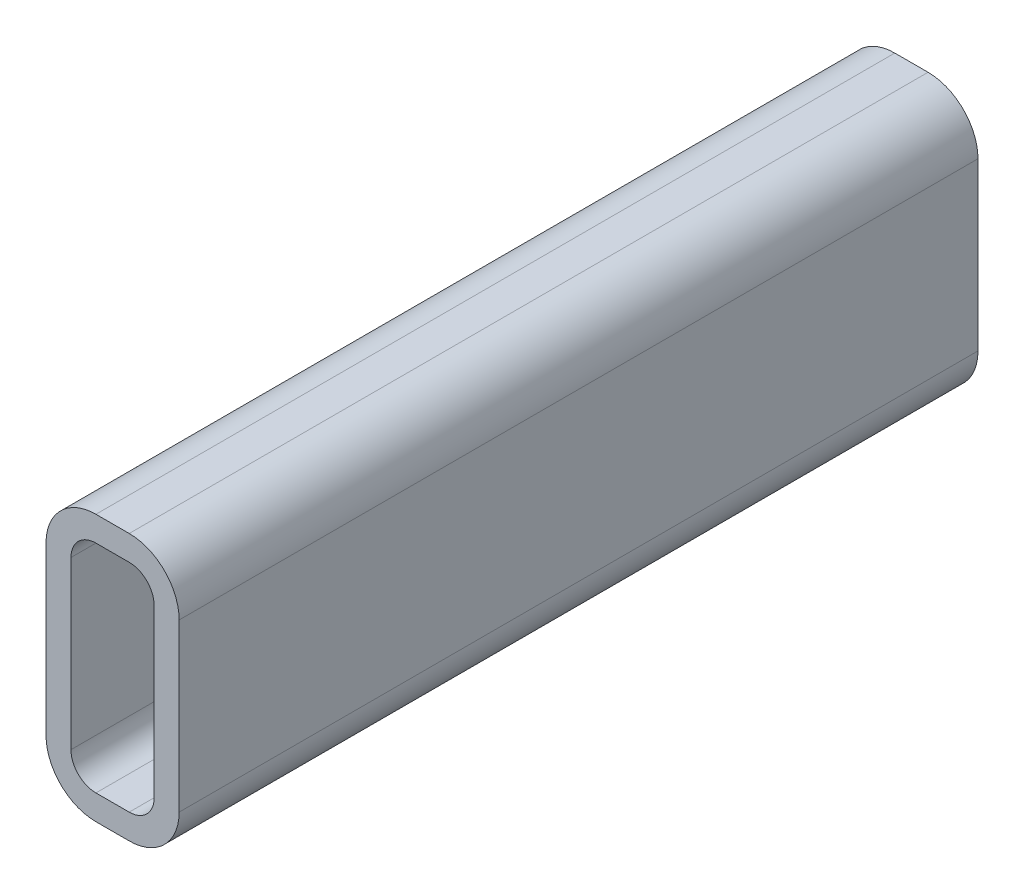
ISO-10303-21;
HEADER;
FILE_DESCRIPTION(('STEP AP214'),'2;1');
FILE_NAME('part.step','',(''),(''),'','','');
FILE_SCHEMA(('AUTOMOTIVE_DESIGN { 1 0 10303 214 1 1 1 1 }'));
ENDSEC;
DATA;
#1=APPLICATION_CONTEXT('core data for automotive mechanical design processes');
#2=APPLICATION_PROTOCOL_DEFINITION('international standard','automotive_design',2000,#1);
#3=PRODUCT_CONTEXT('',#1,'mechanical');
#4=PRODUCT('Part','Part','',(#3));
#5=PRODUCT_RELATED_PRODUCT_CATEGORY('part','',(#4));
#6=PRODUCT_DEFINITION_FORMATION('','',#4);
#7=PRODUCT_DEFINITION_CONTEXT('part definition',#1,'design');
#8=PRODUCT_DEFINITION('design','',#6,#7);
#9=PRODUCT_DEFINITION_SHAPE('','',#8);
#10=(LENGTH_UNIT() NAMED_UNIT(*) SI_UNIT(.MILLI.,.METRE.));
#11=(NAMED_UNIT(*) PLANE_ANGLE_UNIT() SI_UNIT($,.RADIAN.));
#12=(NAMED_UNIT(*) SI_UNIT($,.STERADIAN.) SOLID_ANGLE_UNIT());
#13=UNCERTAINTY_MEASURE_WITH_UNIT(LENGTH_MEASURE(1.E-05),#10,'distance_accuracy_value','');
#14=(GEOMETRIC_REPRESENTATION_CONTEXT(3) GLOBAL_UNCERTAINTY_ASSIGNED_CONTEXT((#13)) GLOBAL_UNIT_ASSIGNED_CONTEXT((#10,
#11,#12)) REPRESENTATION_CONTEXT('',''));
#15=CARTESIAN_POINT('',(0.,0.,0.));
#16=DIRECTION('',(0.,0.,1.));
#17=DIRECTION('',(1.,0.,0.));
#18=AXIS2_PLACEMENT_3D('',#15,#16,#17);
#19=CARTESIAN_POINT('',(19.05,82.55,304.8));
#20=DIRECTION('',(0.,0.,1.));
#21=DIRECTION('',(1.,0.,0.));
#22=AXIS2_PLACEMENT_3D('',#19,#20,#21);
#23=PLANE('',#22);
#24=CARTESIAN_POINT('',(19.05,82.55,304.8));
#25=DIRECTION('',(0.,0.,1.));
#26=DIRECTION('',(1.,0.,0.));
#27=AXIS2_PLACEMENT_3D('',#24,#25,#26);
#28=CIRCLE('',#27,19.05);
#29=CARTESIAN_POINT('',(19.05,101.6,304.8));
#30=VERTEX_POINT('',#29);
#31=CARTESIAN_POINT('',(0.,82.55,304.8));
#32=VERTEX_POINT('',#31);
#33=EDGE_CURVE('E211',#30,#32,#28,.T.);
#34=ORIENTED_EDGE('',*,*,#33,.T.);
#35=DIRECTION('',(0.,-1.,0.));
#36=VECTOR('',#35,1.);
#37=CARTESIAN_POINT('',(0.,19.05,304.8));
#38=LINE('',#37,#36);
#39=CARTESIAN_POINT('',(0.,19.05,304.8));
#40=VERTEX_POINT('',#39);
#41=EDGE_CURVE('E214',#32,#40,#38,.T.);
#42=ORIENTED_EDGE('',*,*,#41,.T.);
#43=CARTESIAN_POINT('',(19.05,19.05,304.8));
#44=DIRECTION('',(0.,0.,1.));
#45=DIRECTION('',(1.,0.,0.));
#46=AXIS2_PLACEMENT_3D('',#43,#44,#45);
#47=CIRCLE('',#46,19.05);
#48=CARTESIAN_POINT('',(19.05,0.,304.8));
#49=VERTEX_POINT('',#48);
#50=EDGE_CURVE('E217',#40,#49,#47,.T.);
#51=ORIENTED_EDGE('',*,*,#50,.T.);
#52=DIRECTION('',(1.,0.,0.));
#53=VECTOR('',#52,1.);
#54=CARTESIAN_POINT('',(31.75,0.,304.8));
#55=LINE('',#54,#53);
#56=CARTESIAN_POINT('',(31.75,0.,304.8));
#57=VERTEX_POINT('',#56);
#58=EDGE_CURVE('E219',#49,#57,#55,.T.);
#59=ORIENTED_EDGE('',*,*,#58,.T.);
#60=CARTESIAN_POINT('',(31.75,19.05,304.8));
#61=DIRECTION('',(0.,0.,1.));
#62=DIRECTION('',(1.,0.,0.));
#63=AXIS2_PLACEMENT_3D('',#60,#61,#62);
#64=CIRCLE('',#63,19.05);
#65=CARTESIAN_POINT('',(50.8,19.05,304.8));
#66=VERTEX_POINT('',#65);
#67=EDGE_CURVE('E221',#57,#66,#64,.T.);
#68=ORIENTED_EDGE('',*,*,#67,.T.);
#69=DIRECTION('',(0.,1.,0.));
#70=VECTOR('',#69,1.);
#71=CARTESIAN_POINT('',(50.8,82.55,304.8));
#72=LINE('',#71,#70);
#73=CARTESIAN_POINT('',(50.8,82.55,304.8));
#74=VERTEX_POINT('',#73);
#75=EDGE_CURVE('E223',#66,#74,#72,.T.);
#76=ORIENTED_EDGE('',*,*,#75,.T.);
#77=CARTESIAN_POINT('',(31.75,82.55,304.8));
#78=DIRECTION('',(0.,0.,1.));
#79=DIRECTION('',(1.,0.,0.));
#80=AXIS2_PLACEMENT_3D('',#77,#78,#79);
#81=CIRCLE('',#80,19.05);
#82=CARTESIAN_POINT('',(31.75,101.6,304.8));
#83=VERTEX_POINT('',#82);
#84=EDGE_CURVE('E225',#74,#83,#81,.T.);
#85=ORIENTED_EDGE('',*,*,#84,.T.);
#86=DIRECTION('',(-1.,0.,0.));
#87=VECTOR('',#86,1.);
#88=CARTESIAN_POINT('',(19.05,101.6,304.8));
#89=LINE('',#88,#87);
#90=EDGE_CURVE('E227',#83,#30,#89,.T.);
#91=ORIENTED_EDGE('',*,*,#90,.T.);
#92=EDGE_LOOP('',(#34,#42,#51,#59,#68,#76,#85,#91));
#93=FACE_BOUND('',#92,.T.);
#94=DIRECTION('',(0.,-1.,0.));
#95=VECTOR('',#94,1.);
#96=CARTESIAN_POINT('',(9.525,19.05,304.8));
#97=LINE('',#96,#95);
#98=CARTESIAN_POINT('',(9.525,82.55,304.8));
#99=VERTEX_POINT('',#98);
#100=CARTESIAN_POINT('',(9.525,19.05,304.8));
#101=VERTEX_POINT('',#100);
#102=EDGE_CURVE('E154',#99,#101,#97,.T.);
#103=ORIENTED_EDGE('',*,*,#102,.F.);
#104=CARTESIAN_POINT('',(19.05,82.55,304.8));
#105=DIRECTION('',(0.,0.,1.));
#106=DIRECTION('',(1.,0.,0.));
#107=AXIS2_PLACEMENT_3D('',#104,#105,#106);
#108=CIRCLE('',#107,9.525);
#109=CARTESIAN_POINT('',(19.05,92.075,304.8));
#110=VERTEX_POINT('',#109);
#111=EDGE_CURVE('E146',#110,#99,#108,.T.);
#112=ORIENTED_EDGE('',*,*,#111,.F.);
#113=DIRECTION('',(-1.,0.,0.));
#114=VECTOR('',#113,1.);
#115=CARTESIAN_POINT('',(19.05,92.075,304.8));
#116=LINE('',#115,#114);
#117=CARTESIAN_POINT('',(31.75,92.075,304.8));
#118=VERTEX_POINT('',#117);
#119=EDGE_CURVE('E179',#118,#110,#116,.T.);
#120=ORIENTED_EDGE('',*,*,#119,.F.);
#121=CARTESIAN_POINT('',(31.75,82.55,304.8));
#122=DIRECTION('',(0.,0.,1.));
#123=DIRECTION('',(1.,0.,0.));
#124=AXIS2_PLACEMENT_3D('',#121,#122,#123);
#125=CIRCLE('',#124,9.525);
#126=CARTESIAN_POINT('',(41.275,82.55,304.8));
#127=VERTEX_POINT('',#126);
#128=EDGE_CURVE('E177',#127,#118,#125,.T.);
#129=ORIENTED_EDGE('',*,*,#128,.F.);
#130=DIRECTION('',(0.,1.,0.));
#131=VECTOR('',#130,1.);
#132=CARTESIAN_POINT('',(41.275,82.55,304.8));
#133=LINE('',#132,#131);
#134=CARTESIAN_POINT('',(41.275,19.05,304.8));
#135=VERTEX_POINT('',#134);
#136=EDGE_CURVE('E175',#135,#127,#133,.T.);
#137=ORIENTED_EDGE('',*,*,#136,.F.);
#138=CARTESIAN_POINT('',(31.75,19.05,304.8));
#139=DIRECTION('',(0.,0.,1.));
#140=DIRECTION('',(1.,0.,0.));
#141=AXIS2_PLACEMENT_3D('',#138,#139,#140);
#142=CIRCLE('',#141,9.525);
#143=CARTESIAN_POINT('',(31.75,9.525,304.8));
#144=VERTEX_POINT('',#143);
#145=EDGE_CURVE('E173',#144,#135,#142,.T.);
#146=ORIENTED_EDGE('',*,*,#145,.F.);
#147=DIRECTION('',(1.,0.,0.));
#148=VECTOR('',#147,1.);
#149=CARTESIAN_POINT('',(31.75,9.525,304.8));
#150=LINE('',#149,#148);
#151=CARTESIAN_POINT('',(19.05,9.525,304.8));
#152=VERTEX_POINT('',#151);
#153=EDGE_CURVE('E169',#152,#144,#150,.T.);
#154=ORIENTED_EDGE('',*,*,#153,.F.);
#155=CARTESIAN_POINT('',(19.05,19.05,304.8));
#156=DIRECTION('',(0.,0.,1.));
#157=DIRECTION('',(1.,0.,0.));
#158=AXIS2_PLACEMENT_3D('',#155,#156,#157);
#159=CIRCLE('',#158,9.525);
#160=EDGE_CURVE('E167',#101,#152,#159,.T.);
#161=ORIENTED_EDGE('',*,*,#160,.F.);
#162=EDGE_LOOP('',(#103,#112,#120,#129,#137,#146,#154,#161));
#163=FACE_BOUND('',#162,.T.);
#164=ADVANCED_FACE('F33',(#93,#163),#23,.T.);
#165=CARTESIAN_POINT('',(19.05,82.55,0.));
#166=DIRECTION('',(0.,0.,1.));
#167=DIRECTION('',(1.,0.,0.));
#168=AXIS2_PLACEMENT_3D('',#165,#166,#167);
#169=PLANE('',#168);
#170=CARTESIAN_POINT('',(19.05,82.55,0.));
#171=DIRECTION('',(0.,0.,1.));
#172=DIRECTION('',(1.,0.,0.));
#173=AXIS2_PLACEMENT_3D('',#170,#171,#172);
#174=CIRCLE('',#173,19.05);
#175=CARTESIAN_POINT('',(19.05,101.6,0.));
#176=VERTEX_POINT('',#175);
#177=CARTESIAN_POINT('',(0.,82.55,0.));
#178=VERTEX_POINT('',#177);
#179=EDGE_CURVE('E162',#176,#178,#174,.T.);
#180=ORIENTED_EDGE('',*,*,#179,.F.);
#181=DIRECTION('',(-1.,0.,0.));
#182=VECTOR('',#181,1.);
#183=CARTESIAN_POINT('',(19.05,101.6,0.));
#184=LINE('',#183,#182);
#185=CARTESIAN_POINT('',(31.75,101.6,0.));
#186=VERTEX_POINT('',#185);
#187=EDGE_CURVE('E215',#186,#176,#184,.T.);
#188=ORIENTED_EDGE('',*,*,#187,.F.);
#189=CARTESIAN_POINT('',(31.75,82.55,0.));
#190=DIRECTION('',(0.,0.,1.));
#191=DIRECTION('',(1.,0.,0.));
#192=AXIS2_PLACEMENT_3D('',#189,#190,#191);
#193=CIRCLE('',#192,19.05);
#194=CARTESIAN_POINT('',(50.8,82.55,0.));
#195=VERTEX_POINT('',#194);
#196=EDGE_CURVE('E242',#195,#186,#193,.T.);
#197=ORIENTED_EDGE('',*,*,#196,.F.);
#198=DIRECTION('',(0.,1.,0.));
#199=VECTOR('',#198,1.);
#200=CARTESIAN_POINT('',(50.8,82.55,0.));
#201=LINE('',#200,#199);
#202=CARTESIAN_POINT('',(50.8,19.05,0.));
#203=VERTEX_POINT('',#202);
#204=EDGE_CURVE('E240',#203,#195,#201,.T.);
#205=ORIENTED_EDGE('',*,*,#204,.F.);
#206=CARTESIAN_POINT('',(31.75,19.05,0.));
#207=DIRECTION('',(0.,0.,1.));
#208=DIRECTION('',(1.,0.,0.));
#209=AXIS2_PLACEMENT_3D('',#206,#207,#208);
#210=CIRCLE('',#209,19.05);
#211=CARTESIAN_POINT('',(31.75,0.,0.));
#212=VERTEX_POINT('',#211);
#213=EDGE_CURVE('E238',#212,#203,#210,.T.);
#214=ORIENTED_EDGE('',*,*,#213,.F.);
#215=DIRECTION('',(1.,0.,0.));
#216=VECTOR('',#215,1.);
#217=CARTESIAN_POINT('',(31.75,0.,0.));
#218=LINE('',#217,#216);
#219=CARTESIAN_POINT('',(19.05,0.,0.));
#220=VERTEX_POINT('',#219);
#221=EDGE_CURVE('E236',#220,#212,#218,.T.);
#222=ORIENTED_EDGE('',*,*,#221,.F.);
#223=CARTESIAN_POINT('',(19.05,19.05,0.));
#224=DIRECTION('',(0.,0.,1.));
#225=DIRECTION('',(1.,0.,0.));
#226=AXIS2_PLACEMENT_3D('',#223,#224,#225);
#227=CIRCLE('',#226,19.05);
#228=CARTESIAN_POINT('',(0.,19.05,0.));
#229=VERTEX_POINT('',#228);
#230=EDGE_CURVE('E234',#229,#220,#227,.T.);
#231=ORIENTED_EDGE('',*,*,#230,.F.);
#232=DIRECTION('',(0.,-1.,0.));
#233=VECTOR('',#232,1.);
#234=CARTESIAN_POINT('',(0.,19.05,0.));
#235=LINE('',#234,#233);
#236=EDGE_CURVE('E232',#178,#229,#235,.T.);
#237=ORIENTED_EDGE('',*,*,#236,.F.);
#238=EDGE_LOOP('',(#180,#188,#197,#205,#214,#222,#231,#237));
#239=FACE_BOUND('',#238,.T.);
#240=CARTESIAN_POINT('',(19.05,82.55,0.));
#241=DIRECTION('',(0.,0.,1.));
#242=DIRECTION('',(1.,0.,0.));
#243=AXIS2_PLACEMENT_3D('',#240,#241,#242);
#244=CIRCLE('',#243,9.525);
#245=CARTESIAN_POINT('',(19.05,92.075,0.));
#246=VERTEX_POINT('',#245);
#247=CARTESIAN_POINT('',(9.525,82.55,0.));
#248=VERTEX_POINT('',#247);
#249=EDGE_CURVE('E56',#246,#248,#244,.T.);
#250=ORIENTED_EDGE('',*,*,#249,.T.);
#251=DIRECTION('',(0.,-1.,0.));
#252=VECTOR('',#251,1.);
#253=CARTESIAN_POINT('',(9.525,19.05,0.));
#254=LINE('',#253,#252);
#255=CARTESIAN_POINT('',(9.525,19.05,0.));
#256=VERTEX_POINT('',#255);
#257=EDGE_CURVE('E161',#248,#256,#254,.T.);
#258=ORIENTED_EDGE('',*,*,#257,.T.);
#259=CARTESIAN_POINT('',(19.05,19.05,0.));
#260=DIRECTION('',(0.,0.,1.));
#261=DIRECTION('',(1.,0.,0.));
#262=AXIS2_PLACEMENT_3D('',#259,#260,#261);
#263=CIRCLE('',#262,9.525);
#264=CARTESIAN_POINT('',(19.05,9.525,0.));
#265=VERTEX_POINT('',#264);
#266=EDGE_CURVE('E183',#256,#265,#263,.T.);
#267=ORIENTED_EDGE('',*,*,#266,.T.);
#268=DIRECTION('',(1.,0.,0.));
#269=VECTOR('',#268,1.);
#270=CARTESIAN_POINT('',(31.75,9.525,0.));
#271=LINE('',#270,#269);
#272=CARTESIAN_POINT('',(31.75,9.525,0.));
#273=VERTEX_POINT('',#272);
#274=EDGE_CURVE('E186',#265,#273,#271,.T.);
#275=ORIENTED_EDGE('',*,*,#274,.T.);
#276=CARTESIAN_POINT('',(31.75,19.05,0.));
#277=DIRECTION('',(0.,0.,1.));
#278=DIRECTION('',(1.,0.,0.));
#279=AXIS2_PLACEMENT_3D('',#276,#277,#278);
#280=CIRCLE('',#279,9.525);
#281=CARTESIAN_POINT('',(41.275,19.05,0.));
#282=VERTEX_POINT('',#281);
#283=EDGE_CURVE('E189',#273,#282,#280,.T.);
#284=ORIENTED_EDGE('',*,*,#283,.T.);
#285=DIRECTION('',(0.,1.,0.));
#286=VECTOR('',#285,1.);
#287=CARTESIAN_POINT('',(41.275,82.55,0.));
#288=LINE('',#287,#286);
#289=CARTESIAN_POINT('',(41.275,82.55,0.));
#290=VERTEX_POINT('',#289);
#291=EDGE_CURVE('E192',#282,#290,#288,.T.);
#292=ORIENTED_EDGE('',*,*,#291,.T.);
#293=CARTESIAN_POINT('',(31.75,82.55,0.));
#294=DIRECTION('',(0.,0.,1.));
#295=DIRECTION('',(1.,0.,0.));
#296=AXIS2_PLACEMENT_3D('',#293,#294,#295);
#297=CIRCLE('',#296,9.525);
#298=CARTESIAN_POINT('',(31.75,92.075,0.));
#299=VERTEX_POINT('',#298);
#300=EDGE_CURVE('E195',#290,#299,#297,.T.);
#301=ORIENTED_EDGE('',*,*,#300,.T.);
#302=DIRECTION('',(-1.,0.,0.));
#303=VECTOR('',#302,1.);
#304=CARTESIAN_POINT('',(19.05,92.075,0.));
#305=LINE('',#304,#303);
#306=EDGE_CURVE('E155',#299,#246,#305,.T.);
#307=ORIENTED_EDGE('',*,*,#306,.T.);
#308=EDGE_LOOP('',(#250,#258,#267,#275,#284,#292,#301,#307));
#309=FACE_BOUND('',#308,.T.);
#310=ADVANCED_FACE('F272',(#239,#309),#169,.F.);
#311=CARTESIAN_POINT('',(19.05,82.55,304.8));
#312=DIRECTION('',(0.,0.,-1.));
#313=DIRECTION('',(-1.,0.,0.));
#314=AXIS2_PLACEMENT_3D('',#311,#312,#313);
#315=CYLINDRICAL_SURFACE('',#314,19.05);
#316=ORIENTED_EDGE('',*,*,#179,.T.);
#317=DIRECTION('',(0.,0.,-1.));
#318=VECTOR('',#317,1.);
#319=CARTESIAN_POINT('',(0.,82.55,304.8));
#320=LINE('',#319,#318);
#321=EDGE_CURVE('E11',#32,#178,#320,.T.);
#322=ORIENTED_EDGE('',*,*,#321,.F.);
#323=ORIENTED_EDGE('',*,*,#33,.F.);
#324=DIRECTION('',(0.,0.,-1.));
#325=VECTOR('',#324,1.);
#326=CARTESIAN_POINT('',(19.05,101.6,304.8));
#327=LINE('',#326,#325);
#328=EDGE_CURVE('E229',#30,#176,#327,.T.);
#329=ORIENTED_EDGE('',*,*,#328,.T.);
#330=EDGE_LOOP('',(#316,#322,#323,#329));
#331=FACE_BOUND('',#330,.T.);
#332=ADVANCED_FACE('F35',(#331),#315,.T.);
#333=CARTESIAN_POINT('',(0.,19.05,304.8));
#334=DIRECTION('',(1.,0.,0.));
#335=DIRECTION('',(0.,0.,-1.));
#336=AXIS2_PLACEMENT_3D('',#333,#334,#335);
#337=PLANE('',#336);
#338=ORIENTED_EDGE('',*,*,#236,.T.);
#339=DIRECTION('',(0.,0.,-1.));
#340=VECTOR('',#339,1.);
#341=CARTESIAN_POINT('',(0.,19.05,304.8));
#342=LINE('',#341,#340);
#343=EDGE_CURVE('E41',#40,#229,#342,.T.);
#344=ORIENTED_EDGE('',*,*,#343,.F.);
#345=ORIENTED_EDGE('',*,*,#41,.F.);
#346=ORIENTED_EDGE('',*,*,#321,.T.);
#347=EDGE_LOOP('',(#338,#344,#345,#346));
#348=FACE_BOUND('',#347,.T.);
#349=ADVANCED_FACE('F289',(#348),#337,.F.);
#350=CARTESIAN_POINT('',(19.05,19.05,304.8));
#351=DIRECTION('',(0.,0.,-1.));
#352=DIRECTION('',(-1.,0.,0.));
#353=AXIS2_PLACEMENT_3D('',#350,#351,#352);
#354=CYLINDRICAL_SURFACE('',#353,19.05);
#355=ORIENTED_EDGE('',*,*,#230,.T.);
#356=DIRECTION('',(0.,0.,-1.));
#357=VECTOR('',#356,1.);
#358=CARTESIAN_POINT('',(19.05,0.,304.8));
#359=LINE('',#358,#357);
#360=EDGE_CURVE('E259',#49,#220,#359,.T.);
#361=ORIENTED_EDGE('',*,*,#360,.F.);
#362=ORIENTED_EDGE('',*,*,#50,.F.);
#363=ORIENTED_EDGE('',*,*,#343,.T.);
#364=EDGE_LOOP('',(#355,#361,#362,#363));
#365=FACE_BOUND('',#364,.T.);
#366=ADVANCED_FACE('F266',(#365),#354,.T.);
#367=CARTESIAN_POINT('',(31.75,0.,304.8));
#368=DIRECTION('',(0.,1.,0.));
#369=DIRECTION('',(0.,0.,1.));
#370=AXIS2_PLACEMENT_3D('',#367,#368,#369);
#371=PLANE('',#370);
#372=ORIENTED_EDGE('',*,*,#221,.T.);
#373=DIRECTION('',(0.,0.,-1.));
#374=VECTOR('',#373,1.);
#375=CARTESIAN_POINT('',(31.75,0.,304.8));
#376=LINE('',#375,#374);
#377=EDGE_CURVE('E256',#57,#212,#376,.T.);
#378=ORIENTED_EDGE('',*,*,#377,.F.);
#379=ORIENTED_EDGE('',*,*,#58,.F.);
#380=ORIENTED_EDGE('',*,*,#360,.T.);
#381=EDGE_LOOP('',(#372,#378,#379,#380));
#382=FACE_BOUND('',#381,.T.);
#383=ADVANCED_FACE('F278',(#382),#371,.F.);
#384=CARTESIAN_POINT('',(31.75,19.05,304.8));
#385=DIRECTION('',(0.,0.,-1.));
#386=DIRECTION('',(-1.,0.,0.));
#387=AXIS2_PLACEMENT_3D('',#384,#385,#386);
#388=CYLINDRICAL_SURFACE('',#387,19.05);
#389=ORIENTED_EDGE('',*,*,#213,.T.);
#390=DIRECTION('',(0.,0.,-1.));
#391=VECTOR('',#390,1.);
#392=CARTESIAN_POINT('',(50.8,19.05,304.8));
#393=LINE('',#392,#391);
#394=EDGE_CURVE('E253',#66,#203,#393,.T.);
#395=ORIENTED_EDGE('',*,*,#394,.F.);
#396=ORIENTED_EDGE('',*,*,#67,.F.);
#397=ORIENTED_EDGE('',*,*,#377,.T.);
#398=EDGE_LOOP('',(#389,#395,#396,#397));
#399=FACE_BOUND('',#398,.T.);
#400=ADVANCED_FACE('F282',(#399),#388,.T.);
#401=CARTESIAN_POINT('',(50.8,82.55,304.8));
#402=DIRECTION('',(-1.,0.,0.));
#403=DIRECTION('',(0.,0.,1.));
#404=AXIS2_PLACEMENT_3D('',#401,#402,#403);
#405=PLANE('',#404);
#406=ORIENTED_EDGE('',*,*,#204,.T.);
#407=DIRECTION('',(0.,0.,-1.));
#408=VECTOR('',#407,1.);
#409=CARTESIAN_POINT('',(50.8,82.55,304.8));
#410=LINE('',#409,#408);
#411=EDGE_CURVE('E250',#74,#195,#410,.T.);
#412=ORIENTED_EDGE('',*,*,#411,.F.);
#413=ORIENTED_EDGE('',*,*,#75,.F.);
#414=ORIENTED_EDGE('',*,*,#394,.T.);
#415=EDGE_LOOP('',(#406,#412,#413,#414));
#416=FACE_BOUND('',#415,.T.);
#417=ADVANCED_FACE('F302',(#416),#405,.F.);
#418=CARTESIAN_POINT('',(31.75,82.55,304.8));
#419=DIRECTION('',(0.,0.,-1.));
#420=DIRECTION('',(-1.,0.,0.));
#421=AXIS2_PLACEMENT_3D('',#418,#419,#420);
#422=CYLINDRICAL_SURFACE('',#421,19.05);
#423=ORIENTED_EDGE('',*,*,#196,.T.);
#424=DIRECTION('',(0.,0.,-1.));
#425=VECTOR('',#424,1.);
#426=CARTESIAN_POINT('',(31.75,101.6,304.8));
#427=LINE('',#426,#425);
#428=EDGE_CURVE('E247',#83,#186,#427,.T.);
#429=ORIENTED_EDGE('',*,*,#428,.F.);
#430=ORIENTED_EDGE('',*,*,#84,.F.);
#431=ORIENTED_EDGE('',*,*,#411,.T.);
#432=EDGE_LOOP('',(#423,#429,#430,#431));
#433=FACE_BOUND('',#432,.T.);
#434=ADVANCED_FACE('F300',(#433),#422,.T.);
#435=CARTESIAN_POINT('',(19.05,101.6,304.8));
#436=DIRECTION('',(0.,-1.,0.));
#437=DIRECTION('',(0.,0.,-1.));
#438=AXIS2_PLACEMENT_3D('',#435,#436,#437);
#439=PLANE('',#438);
#440=ORIENTED_EDGE('',*,*,#187,.T.);
#441=ORIENTED_EDGE('',*,*,#328,.F.);
#442=ORIENTED_EDGE('',*,*,#90,.F.);
#443=ORIENTED_EDGE('',*,*,#428,.T.);
#444=EDGE_LOOP('',(#440,#441,#442,#443));
#445=FACE_BOUND('',#444,.T.);
#446=ADVANCED_FACE('F295',(#445),#439,.F.);
#447=CARTESIAN_POINT('',(19.05,82.55,304.8));
#448=DIRECTION('',(0.,0.,-1.));
#449=DIRECTION('',(-1.,0.,0.));
#450=AXIS2_PLACEMENT_3D('',#447,#448,#449);
#451=CYLINDRICAL_SURFACE('',#450,9.525);
#452=ORIENTED_EDGE('',*,*,#249,.F.);
#453=DIRECTION('',(0.,0.,-1.));
#454=VECTOR('',#453,1.);
#455=CARTESIAN_POINT('',(19.05,92.075,304.8));
#456=LINE('',#455,#454);
#457=EDGE_CURVE('E150',#110,#246,#456,.T.);
#458=ORIENTED_EDGE('',*,*,#457,.F.);
#459=ORIENTED_EDGE('',*,*,#111,.T.);
#460=DIRECTION('',(0.,0.,-1.));
#461=VECTOR('',#460,1.);
#462=CARTESIAN_POINT('',(9.525,82.55,304.8));
#463=LINE('',#462,#461);
#464=EDGE_CURVE('E149',#99,#248,#463,.T.);
#465=ORIENTED_EDGE('',*,*,#464,.T.);
#466=EDGE_LOOP('',(#452,#458,#459,#465));
#467=FACE_BOUND('',#466,.T.);
#468=ADVANCED_FACE('F148',(#467),#451,.F.);
#469=CARTESIAN_POINT('',(9.525,19.05,304.8));
#470=DIRECTION('',(1.,0.,0.));
#471=DIRECTION('',(0.,0.,-1.));
#472=AXIS2_PLACEMENT_3D('',#469,#470,#471);
#473=PLANE('',#472);
#474=ORIENTED_EDGE('',*,*,#257,.F.);
#475=ORIENTED_EDGE('',*,*,#464,.F.);
#476=ORIENTED_EDGE('',*,*,#102,.T.);
#477=DIRECTION('',(0.,0.,-1.));
#478=VECTOR('',#477,1.);
#479=CARTESIAN_POINT('',(9.525,19.05,304.8));
#480=LINE('',#479,#478);
#481=EDGE_CURVE('E163',#101,#256,#480,.T.);
#482=ORIENTED_EDGE('',*,*,#481,.T.);
#483=EDGE_LOOP('',(#474,#475,#476,#482));
#484=FACE_BOUND('',#483,.T.);
#485=ADVANCED_FACE('F158',(#484),#473,.T.);
#486=CARTESIAN_POINT('',(19.05,19.05,304.8));
#487=DIRECTION('',(0.,0.,-1.));
#488=DIRECTION('',(-1.,0.,0.));
#489=AXIS2_PLACEMENT_3D('',#486,#487,#488);
#490=CYLINDRICAL_SURFACE('',#489,9.525);
#491=ORIENTED_EDGE('',*,*,#266,.F.);
#492=ORIENTED_EDGE('',*,*,#481,.F.);
#493=ORIENTED_EDGE('',*,*,#160,.T.);
#494=DIRECTION('',(0.,0.,-1.));
#495=VECTOR('',#494,1.);
#496=CARTESIAN_POINT('',(19.05,9.525,304.8));
#497=LINE('',#496,#495);
#498=EDGE_CURVE('E208',#152,#265,#497,.T.);
#499=ORIENTED_EDGE('',*,*,#498,.T.);
#500=EDGE_LOOP('',(#491,#492,#493,#499));
#501=FACE_BOUND('',#500,.T.);
#502=ADVANCED_FACE('F327',(#501),#490,.F.);
#503=CARTESIAN_POINT('',(31.75,9.525,304.8));
#504=DIRECTION('',(0.,1.,0.));
#505=DIRECTION('',(0.,0.,1.));
#506=AXIS2_PLACEMENT_3D('',#503,#504,#505);
#507=PLANE('',#506);
#508=ORIENTED_EDGE('',*,*,#274,.F.);
#509=ORIENTED_EDGE('',*,*,#498,.F.);
#510=ORIENTED_EDGE('',*,*,#153,.T.);
#511=DIRECTION('',(0.,0.,-1.));
#512=VECTOR('',#511,1.);
#513=CARTESIAN_POINT('',(31.75,9.525,304.8));
#514=LINE('',#513,#512);
#515=EDGE_CURVE('E206',#144,#273,#514,.T.);
#516=ORIENTED_EDGE('',*,*,#515,.T.);
#517=EDGE_LOOP('',(#508,#509,#510,#516));
#518=FACE_BOUND('',#517,.T.);
#519=ADVANCED_FACE('F331',(#518),#507,.T.);
#520=CARTESIAN_POINT('',(31.75,19.05,304.8));
#521=DIRECTION('',(0.,0.,-1.));
#522=DIRECTION('',(-1.,0.,0.));
#523=AXIS2_PLACEMENT_3D('',#520,#521,#522);
#524=CYLINDRICAL_SURFACE('',#523,9.525);
#525=ORIENTED_EDGE('',*,*,#283,.F.);
#526=ORIENTED_EDGE('',*,*,#515,.F.);
#527=ORIENTED_EDGE('',*,*,#145,.T.);
#528=DIRECTION('',(0.,0.,-1.));
#529=VECTOR('',#528,1.);
#530=CARTESIAN_POINT('',(41.275,19.05,304.8));
#531=LINE('',#530,#529);
#532=EDGE_CURVE('E204',#135,#282,#531,.T.);
#533=ORIENTED_EDGE('',*,*,#532,.T.);
#534=EDGE_LOOP('',(#525,#526,#527,#533));
#535=FACE_BOUND('',#534,.T.);
#536=ADVANCED_FACE('F337',(#535),#524,.F.);
#537=CARTESIAN_POINT('',(41.275,82.55,304.8));
#538=DIRECTION('',(-1.,0.,0.));
#539=DIRECTION('',(0.,0.,1.));
#540=AXIS2_PLACEMENT_3D('',#537,#538,#539);
#541=PLANE('',#540);
#542=ORIENTED_EDGE('',*,*,#291,.F.);
#543=ORIENTED_EDGE('',*,*,#532,.F.);
#544=ORIENTED_EDGE('',*,*,#136,.T.);
#545=DIRECTION('',(0.,0.,-1.));
#546=VECTOR('',#545,1.);
#547=CARTESIAN_POINT('',(41.275,82.55,304.8));
#548=LINE('',#547,#546);
#549=EDGE_CURVE('E202',#127,#290,#548,.T.);
#550=ORIENTED_EDGE('',*,*,#549,.T.);
#551=EDGE_LOOP('',(#542,#543,#544,#550));
#552=FACE_BOUND('',#551,.T.);
#553=ADVANCED_FACE('F341',(#552),#541,.T.);
#554=CARTESIAN_POINT('',(31.75,82.55,304.8));
#555=DIRECTION('',(0.,0.,-1.));
#556=DIRECTION('',(-1.,0.,0.));
#557=AXIS2_PLACEMENT_3D('',#554,#555,#556);
#558=CYLINDRICAL_SURFACE('',#557,9.525);
#559=ORIENTED_EDGE('',*,*,#300,.F.);
#560=ORIENTED_EDGE('',*,*,#549,.F.);
#561=ORIENTED_EDGE('',*,*,#128,.T.);
#562=DIRECTION('',(0.,0.,-1.));
#563=VECTOR('',#562,1.);
#564=CARTESIAN_POINT('',(31.75,92.075,304.8));
#565=LINE('',#564,#563);
#566=EDGE_CURVE('E48',#118,#299,#565,.T.);
#567=ORIENTED_EDGE('',*,*,#566,.T.);
#568=EDGE_LOOP('',(#559,#560,#561,#567));
#569=FACE_BOUND('',#568,.T.);
#570=ADVANCED_FACE('F345',(#569),#558,.F.);
#571=CARTESIAN_POINT('',(19.05,92.075,304.8));
#572=DIRECTION('',(0.,-1.,0.));
#573=DIRECTION('',(0.,0.,-1.));
#574=AXIS2_PLACEMENT_3D('',#571,#572,#573);
#575=PLANE('',#574);
#576=ORIENTED_EDGE('',*,*,#306,.F.);
#577=ORIENTED_EDGE('',*,*,#566,.F.);
#578=ORIENTED_EDGE('',*,*,#119,.T.);
#579=ORIENTED_EDGE('',*,*,#457,.T.);
#580=EDGE_LOOP('',(#576,#577,#578,#579));
#581=FACE_BOUND('',#580,.T.);
#582=ADVANCED_FACE('F349',(#581),#575,.T.);
#583=CLOSED_SHELL('',(#164,#310,#332,#349,#366,#383,#400,#417,#434,#446,#468,#485,#502,#519,
#536,#553,#570,#582));
#584=MANIFOLD_SOLID_BREP('B2',#583);
#585=ADVANCED_BREP_SHAPE_REPRESENTATION('',(#18,#584),#14);
#586=SHAPE_DEFINITION_REPRESENTATION(#9,#585);
ENDSEC;
END-ISO-10303-21;
